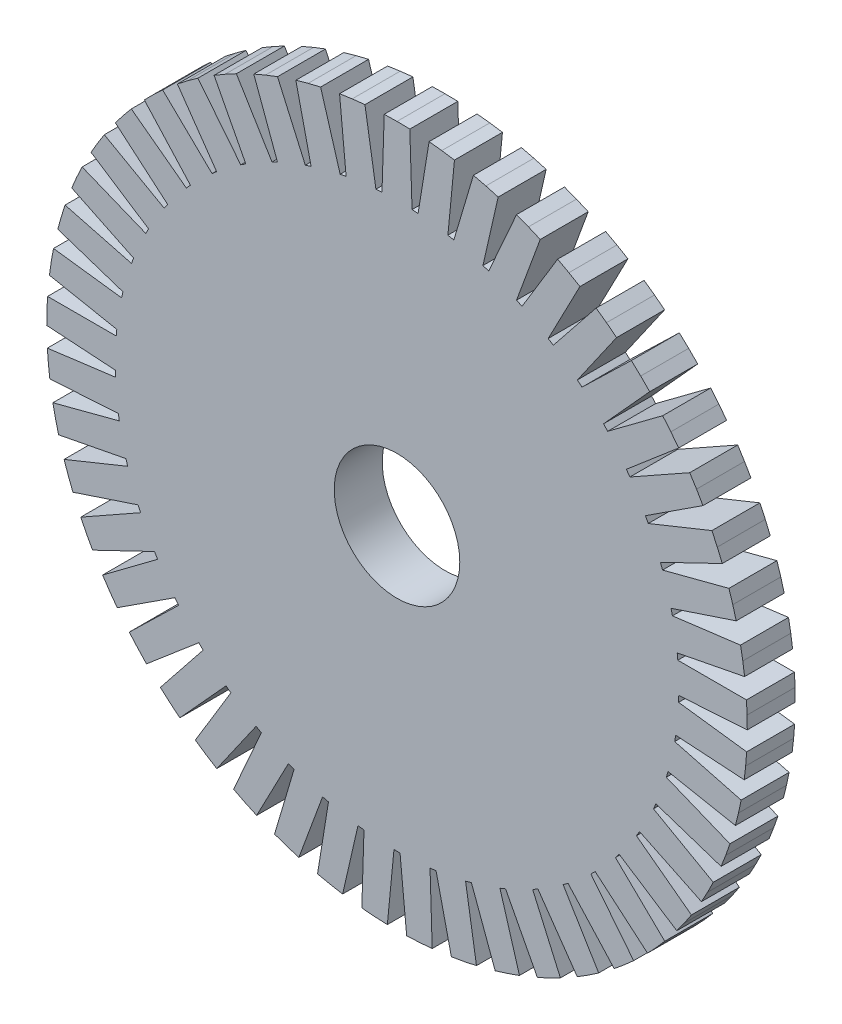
from build123d import *

# Parameters (mm, degrees)
SKETCH2_R           = 3.925
BOSS_EXTRUDE1_DEPTH = 3


with BuildPart() as part:
    # Sketch2 → Boss-Extrude1 (new body)
    with BuildSketch(Plane.XY):
        with BuildLine():
            Line((0, 21.9), (-0.799866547, 21.885388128))
            Line((-0.799866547, 21.885388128), (-0.939665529, 17.59492622))
            ThreePointArc((-0.939665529, 17.59492622), (-1.128917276, 17.58379782), (-1.318038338, 17.57063388))
            Line((-1.318038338, 17.57063388), (-2.005341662, 21.807994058))
            Line((-2.005341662, 21.807994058), (-2.800509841, 21.720201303))
            Line((-2.800509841, 21.720201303), (-3.59194097, 21.60342473))
            Line((-3.59194097, 21.60342473), (-3.181940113, 17.330310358))
            ThreePointArc((-3.181940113, 17.330310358), (-3.368215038, 17.295072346), (-3.554100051, 17.257832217))
            Line((-3.554100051, 17.257832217), (-4.777622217, 21.372513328))
            Line((-4.777622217, 21.372513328), (-5.555035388, 21.183757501))
            Line((-5.555035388, 21.183757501), (-6.325035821, 20.966733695))
            Line((-6.325035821, 20.966733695), (-5.371967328, 16.78113128))
            ThreePointArc((-5.371967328, 16.78113128), (-5.552206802, 16.722362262), (-5.731803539, 16.661657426))
            Line((-5.731803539, 16.661657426), (-7.471454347, 20.58609652))
            Line((-7.471454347, 20.58609652), (-8.218347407, 20.299476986))
            Line((-8.218347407, 20.299476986), (-8.95427376, 19.985769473))
            Line((-8.95427376, 19.985769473), (-7.473786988, 15.956406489))
            ThreePointArc((-7.473786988, 15.956406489), (-7.645031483, 15.875071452), (-7.815390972, 15.791898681))
            Line((-7.815390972, 15.791898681), (-10.042605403, 19.461656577))
            Line((-10.042605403, 19.461656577), (-10.746714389, 19.08187962))
            Line((-10.746714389, 19.08187962), (-11.43648277, 18.676639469))
            Line((-11.43648277, 18.676639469), (-9.452887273, 14.869677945))
            ThreePointArc((-9.452887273, 14.869677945), (-9.612324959, 14.767112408), (-9.770649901, 14.662837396))
            Line((-9.770649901, 14.662837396), (-12.448857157, 18.01765677))
            Line((-12.448857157, 18.01765677), (-13.098620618, 17.550958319))
            Line((-13.098620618, 17.550958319), (-13.73090505, 17.060839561))
            Line((-13.73090505, 17.060839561), (-11.27677141, 13.538789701))
            ThreePointArc((-11.27677141, 13.538789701), (-11.421784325, 13.416677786), (-11.565475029, 13.293012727))
            Line((-11.565475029, 13.293012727), (-14.650699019, 16.277807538))
            Line((-14.650699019, 16.277807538), (-15.235447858, 15.731850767))
            Line((-15.235447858, 15.731850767), (-15.799866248, 15.164901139))
            Line((-15.799866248, 15.164901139), (-12.915491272, 11.985594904))
            ThreePointArc((-12.915491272, 11.985594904), (-13.043698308, 11.845941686), (-13.170395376, 11.704917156))
            Line((-13.170395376, 11.704917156), (-16.611976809, 14.270677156))
            Line((-16.611976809, 14.270677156), (-17.122109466, 13.654426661))
            Line((-17.122109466, 13.654426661), (-17.609394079, 13.019955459))
            Line((-17.609394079, 13.019955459), (-14.342139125, 10.23559697))
            ThreePointArc((-14.342139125, 10.23559697), (-14.451435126, 10.080695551), (-14.559058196, 9.924627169))
            Line((-14.559058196, 9.924627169), (-18.300486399, 12.029222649))
            Line((-18.300486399, 12.029222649), (-18.72762651, 11.352797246))
            Line((-18.72762651, 11.352797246), (-19.129776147, 10.661222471))
            Line((-19.129776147, 10.661222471), (-15.53328945, 8.317530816))
            ThreePointArc((-15.53328945, 8.317530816), (-15.621879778, 8.149924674), (-15.708661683, 7.981375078))
            Line((-15.708661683, 7.981375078), (-19.688502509, 9.590248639))
            Line((-19.688502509, 9.590248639), (-20.025636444, 8.864755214))
            Line((-20.025636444, 8.864755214), (-20.336047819, 8.127432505))
            Line((-20.336047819, 8.127432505), (-16.469383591, 6.262891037))
            ThreePointArc((-16.469383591, 6.262891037), (-16.535813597, 6.085332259), (-16.600329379, 5.907069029))
            Line((-16.600329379, 5.907069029), (-20.753233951, 6.993803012))
            Line((-20.753233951, 6.993803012), (-20.994825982, 6.231154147))
            Line((-20.994825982, 6.231154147), (-21.208402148, 5.460190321))
            Line((-21.208402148, 5.460190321), (-17.135050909, 4.10541476))
            ThreePointArc((-17.135050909, 4.10541476), (-17.178229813, 3.920818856), (-17.219420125, 3.73576907))
            Line((-17.219420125, 3.73576907), (-21.477197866, 4.282519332))
            Line((-21.477197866, 4.282519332), (-21.619281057, 3.495237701))
            Line((-21.619281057, 3.495237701), (-21.7325151, 2.703291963))
            Line((-21.7325151, 2.703291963), (-17.519361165, 1.880527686))
            ThreePointArc((-17.519361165, 1.880527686), (-17.53857997, 1.691925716), (-17.55576847, 1.503127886))
            Line((-17.55576847, 1.503127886), (-21.848506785, 1.500916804))
            Line((-21.848506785, 1.500916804), (-21.888748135, 0.701929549))
            Line((-21.888748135, 0.701929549), (-21.899780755, -0.097994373))
            Line((-21.899780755, -0.097994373), (-17.616003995, -0.375237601))
            ThreePointArc((-17.616003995, -0.375237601), (-17.610947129, -0.564748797), (-17.603851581, -0.754194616))
            Line((-17.603851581, -0.754194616), (-21.861063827, -1.305330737))
            Line((-21.861063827, -1.305330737), (-21.798802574, -2.102904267))
            Line((-21.798802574, -2.102904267), (-21.707452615, -2.897671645))
            Line((-21.707452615, -2.897671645), (-17.423392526, -2.624841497))
            ThreePointArc((-17.423392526, -2.624841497), (-17.394143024, -2.81215015), (-17.362879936, -2.999133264))
            Line((-17.362879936, -2.999133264), (-21.514662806, -4.090144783))
            Line((-21.514662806, -4.090144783), (-21.350921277, -4.873208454))
            Line((-21.350921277, -4.873208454), (-21.158688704, -5.649769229))
            Line((-21.158688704, -5.649769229), (-16.944689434, -4.831345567))
            ThreePointArc((-16.944689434, -4.831345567), (-16.891727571, -5.013376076), (-16.836810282, -5.194826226))
            Line((-16.836810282, -5.194826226), (-20.814991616, -6.807798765))
            Line((-20.814991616, -6.807798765), (-20.552458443, -7.563494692))
            Line((-20.552458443, -7.563494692), (-20.262499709, -8.309097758))
            Line((-20.262499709, -8.309097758), (-16.18775501, -6.958519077))
            ThreePointArc((-16.18775501, -6.958519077), (-16.111950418, -7.132282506), (-16.034280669, -7.305220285))
            Line((-16.034280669, -7.305220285), (-19.773538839, -9.41366888))
            Line((-19.773538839, -9.41366888), (-19.41652481, -10.129588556))
            Line((-19.41652481, -10.129588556), (-19.033601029, -10.831991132))
            Line((-19.033601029, -10.831991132), (-15.165018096, -8.971433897))
            ThreePointArc((-15.165018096, -8.971433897), (-15.067615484, -9.134077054), (-14.968468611, -9.295662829))
            Line((-14.968468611, -9.295662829), (-18.407405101, -11.864966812))
            Line((-18.407405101, -11.864966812), (-17.961772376, -12.529354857))
            Line((-17.961772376, -12.529354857), (-17.492171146, -13.177023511))
            Line((-17.492171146, -13.177023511), (-13.893272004, -10.837038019))
            ThreePointArc((-13.893272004, -10.837038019), (-13.775870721, -10.985890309), (-13.656874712, -11.133470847))
            Line((-13.656874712, -11.133470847), (-16.73902228, -14.121442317))
            Line((-16.73902228, -14.121442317), (-16.212088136, -14.723389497))
            Line((-16.212088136, -14.723389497), (-15.663520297, -15.305689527))
            Line((-15.663520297, -15.305689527), (-12.39339877, -12.524698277))
            ThreePointArc((-12.39339877, -12.524698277), (-12.257926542, -12.657315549), (-12.121035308, -12.78846758))
            Line((-12.121035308, -12.78846758), (-14.795785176, -16.146044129))
            Line((-14.795785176, -16.146044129), (-14.196201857, -16.675666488))
            Line((-14.196201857, -16.675666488), (-13.577674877, -17.183036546))
            Line((-13.577674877, -17.183036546), (-10.69002627, -14.006703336))
            ThreePointArc((-10.69002627, -14.006703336), (-10.538707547, -14.120908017), (-10.386168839, -14.23347803))
            Line((-10.386168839, -14.23347803), (-12.609601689, -17.905528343))
            Line((-12.609601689, -17.905528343), (-11.947214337, -18.354129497))
            Line((-11.947214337, -18.354129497), (-11.268884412, -18.778238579))
            Line((-11.268884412, -18.778238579), (-8.811123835, -15.258718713))
            ThreePointArc((-8.811123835, -15.258718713), (-8.646443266, -15.352635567), (-8.480761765, -15.444775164))
            Line((-8.480761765, -15.444775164), (-10.21636889, -19.371004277))
            Line((-10.21636889, -19.371004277), (-9.502053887, -19.731218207))
            Line((-9.502053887, -19.731218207), (-8.775059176, -20.065102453))
            Line((-8.775059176, -20.065102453), (-6.78754299, -16.26018635))
            ThreePointArc((-6.78754299, -16.26018635), (-6.612204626, -16.332273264), (-6.436100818, -16.402469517))
            Line((-6.436100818, -16.402469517), (-7.655383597, -20.518408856))
            Line((-7.655383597, -20.518408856), (-6.900869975, -20.78432086))
            Line((-6.900869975, -20.78432086), (-6.13714771, -21.022497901))
            Line((-6.13714771, -21.022497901), (-4.652510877, -16.994662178))
            ThreePointArc((-4.652510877, -16.994662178), (-4.469393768, -17.043735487), (-4.285759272, -17.090835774))
            Line((-4.285759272, -17.090835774), (-4.968697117, -21.328901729))
            Line((-4.968697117, -21.328901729), (-4.186373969, -21.496145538))
            Line((-4.186373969, -21.496145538), (-3.398464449, -21.634704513))
            Line((-3.398464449, -21.634704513), (-2.441084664, -17.450086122))
            ThreePointArc((-2.441084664, -17.450086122), (-2.253195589, -17.475340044), (-2.065045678, -17.49857098))
            Line((-2.065045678, -17.49857098), (-2.200424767, -21.789174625))
            Line((-2.200424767, -21.789174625), (-1.403137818, -21.855004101))
            Line((-1.403137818, -21.855004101), (-0.603978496, -21.891669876))
            Line((-0.603978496, -21.891669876), (-0.189575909, -17.618980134))
            ThreePointArc((-0.189575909, -17.618980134), (0, -17.62), (0.189575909, -17.618980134))
            Line((0.189575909, -17.618980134), (0.603978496, -21.891669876))
            Line((0.603978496, -21.891669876), (1.403137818, -21.855004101))
            Line((1.403137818, -21.855004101), (2.200424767, -21.789174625))
            Line((2.200424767, -21.789174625), (2.065045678, -17.49857098))
            ThreePointArc((2.065045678, -17.49857098), (2.253195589, -17.475340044), (2.441084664, -17.450086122))
            Line((2.441084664, -17.450086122), (3.398464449, -21.634704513))
            Line((3.398464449, -21.634704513), (4.186373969, -21.496145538))
            Line((4.186373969, -21.496145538), (4.968697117, -21.328901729))
            Line((4.968697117, -21.328901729), (4.285759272, -17.090835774))
            ThreePointArc((4.285759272, -17.090835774), (4.469393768, -17.043735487), (4.652510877, -16.994662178))
            Line((4.652510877, -16.994662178), (6.13714771, -21.022497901))
            Line((6.13714771, -21.022497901), (6.900869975, -20.78432086))
            Line((6.900869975, -20.78432086), (7.655383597, -20.518408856))
            Line((7.655383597, -20.518408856), (6.436100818, -16.402469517))
            ThreePointArc((6.436100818, -16.402469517), (6.612204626, -16.332273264), (6.78754299, -16.26018635))
            Line((6.78754299, -16.26018635), (8.775059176, -20.065102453))
            Line((8.775059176, -20.065102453), (9.502053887, -19.731218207))
            Line((9.502053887, -19.731218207), (10.21636889, -19.371004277))
            Line((10.21636889, -19.371004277), (8.480761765, -15.444775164))
            ThreePointArc((8.480761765, -15.444775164), (8.646443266, -15.352635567), (8.811123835, -15.258718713))
            Line((8.811123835, -15.258718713), (11.268884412, -18.778238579))
            Line((11.268884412, -18.778238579), (11.947214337, -18.354129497))
            Line((11.947214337, -18.354129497), (12.609601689, -17.905528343))
            Line((12.609601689, -17.905528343), (10.386168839, -14.23347803))
            ThreePointArc((10.386168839, -14.23347803), (10.538707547, -14.120908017), (10.69002627, -14.006703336))
            Line((10.69002627, -14.006703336), (13.577674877, -17.183036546))
            Line((13.577674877, -17.183036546), (14.196201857, -16.675666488))
            Line((14.196201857, -16.675666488), (14.795785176, -16.146044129))
            Line((14.795785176, -16.146044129), (12.121035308, -12.78846758))
            ThreePointArc((12.121035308, -12.78846758), (12.257926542, -12.657315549), (12.39339877, -12.524698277))
            Line((12.39339877, -12.524698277), (15.663520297, -15.305689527))
            Line((15.663520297, -15.305689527), (16.212088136, -14.723389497))
            Line((16.212088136, -14.723389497), (16.73902228, -14.121442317))
            Line((16.73902228, -14.121442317), (13.656874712, -11.133470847))
            ThreePointArc((13.656874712, -11.133470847), (13.775870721, -10.985890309), (13.893272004, -10.837038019))
            Line((13.893272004, -10.837038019), (17.492171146, -13.177023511))
            Line((17.492171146, -13.177023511), (17.961772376, -12.529354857))
            Line((17.961772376, -12.529354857), (18.407405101, -11.864966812))
            Line((18.407405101, -11.864966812), (14.968468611, -9.295662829))
            ThreePointArc((14.968468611, -9.295662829), (15.067615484, -9.134077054), (15.165018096, -8.971433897))
            Line((15.165018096, -8.971433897), (19.033601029, -10.831991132))
            Line((19.033601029, -10.831991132), (19.41652481, -10.129588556))
            Line((19.41652481, -10.129588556), (19.773538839, -9.41366888))
            Line((19.773538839, -9.41366888), (16.034280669, -7.305220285))
            ThreePointArc((16.034280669, -7.305220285), (16.111950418, -7.132282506), (16.18775501, -6.958519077))
            Line((16.18775501, -6.958519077), (20.262499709, -8.309097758))
            Line((20.262499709, -8.309097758), (20.552458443, -7.563494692))
            Line((20.552458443, -7.563494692), (20.814991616, -6.807798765))
            Line((20.814991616, -6.807798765), (16.836810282, -5.194826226))
            ThreePointArc((16.836810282, -5.194826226), (16.891727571, -5.013376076), (16.944689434, -4.831345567))
            Line((16.944689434, -4.831345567), (21.158688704, -5.649769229))
            Line((21.158688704, -5.649769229), (21.350921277, -4.873208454))
            Line((21.350921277, -4.873208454), (21.514662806, -4.090144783))
            Line((21.514662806, -4.090144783), (17.362879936, -2.999133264))
            ThreePointArc((17.362879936, -2.999133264), (17.394143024, -2.81215015), (17.423392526, -2.624841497))
            Line((17.423392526, -2.624841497), (21.707452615, -2.897671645))
            Line((21.707452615, -2.897671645), (21.798802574, -2.102904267))
            Line((21.798802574, -2.102904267), (21.861063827, -1.305330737))
            Line((21.861063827, -1.305330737), (17.603851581, -0.754194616))
            ThreePointArc((17.603851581, -0.754194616), (17.610947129, -0.564748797), (17.616003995, -0.375237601))
            Line((17.616003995, -0.375237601), (21.899780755, -0.097994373))
            Line((21.899780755, -0.097994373), (21.888748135, 0.701929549))
            Line((21.888748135, 0.701929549), (21.848506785, 1.500916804))
            Line((21.848506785, 1.500916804), (17.55576847, 1.503127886))
            ThreePointArc((17.55576847, 1.503127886), (17.53857997, 1.691925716), (17.519361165, 1.880527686))
            Line((17.519361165, 1.880527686), (21.7325151, 2.703291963))
            Line((21.7325151, 2.703291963), (21.619281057, 3.495237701))
            Line((21.619281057, 3.495237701), (21.477197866, 4.282519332))
            Line((21.477197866, 4.282519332), (17.219420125, 3.73576907))
            ThreePointArc((17.219420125, 3.73576907), (17.178229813, 3.920818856), (17.135050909, 4.10541476))
            Line((17.135050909, 4.10541476), (21.208402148, 5.460190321))
            Line((21.208402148, 5.460190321), (20.994825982, 6.231154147))
            Line((20.994825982, 6.231154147), (20.753233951, 6.993803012))
            Line((20.753233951, 6.993803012), (16.600329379, 5.907069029))
            ThreePointArc((16.600329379, 5.907069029), (16.535813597, 6.085332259), (16.469383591, 6.262891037))
            Line((16.469383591, 6.262891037), (20.336047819, 8.127432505))
            Line((20.336047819, 8.127432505), (20.025636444, 8.864755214))
            Line((20.025636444, 8.864755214), (19.688502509, 9.590248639))
            Line((19.688502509, 9.590248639), (15.708661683, 7.981375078))
            ThreePointArc((15.708661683, 7.981375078), (15.621879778, 8.149924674), (15.53328945, 8.317530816))
            Line((15.53328945, 8.317530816), (19.129776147, 10.661222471))
            Line((19.129776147, 10.661222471), (18.72762651, 11.352797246))
            Line((18.72762651, 11.352797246), (18.300486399, 12.029222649))
            Line((18.300486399, 12.029222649), (14.559058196, 9.924627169))
            ThreePointArc((14.559058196, 9.924627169), (14.451435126, 10.080695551), (14.342139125, 10.23559697))
            Line((14.342139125, 10.23559697), (17.609394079, 13.019955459))
            Line((17.609394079, 13.019955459), (17.122109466, 13.654426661))
            Line((17.122109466, 13.654426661), (16.611976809, 14.270677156))
            Line((16.611976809, 14.270677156), (13.170395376, 11.704917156))
            ThreePointArc((13.170395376, 11.704917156), (13.043698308, 11.845941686), (12.915491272, 11.985594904))
            Line((12.915491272, 11.985594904), (15.799866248, 15.164901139))
            Line((15.799866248, 15.164901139), (15.235447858, 15.731850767))
            Line((15.235447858, 15.731850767), (14.650699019, 16.277807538))
            Line((14.650699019, 16.277807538), (11.565475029, 13.293012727))
            ThreePointArc((11.565475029, 13.293012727), (11.421784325, 13.416677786), (11.27677141, 13.538789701))
            Line((11.27677141, 13.538789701), (13.73090505, 17.060839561))
            Line((13.73090505, 17.060839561), (13.098620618, 17.550958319))
            Line((13.098620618, 17.550958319), (12.448857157, 18.01765677))
            Line((12.448857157, 18.01765677), (9.770649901, 14.662837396))
            ThreePointArc((9.770649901, 14.662837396), (9.612324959, 14.767112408), (9.452887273, 14.869677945))
            Line((9.452887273, 14.869677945), (11.43648277, 18.676639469))
            Line((11.43648277, 18.676639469), (10.746714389, 19.08187962))
            Line((10.746714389, 19.08187962), (10.042605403, 19.461656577))
            Line((10.042605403, 19.461656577), (7.815390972, 15.791898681))
            ThreePointArc((7.815390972, 15.791898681), (7.645031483, 15.875071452), (7.473786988, 15.956406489))
            Line((7.473786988, 15.956406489), (8.95427376, 19.985769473))
            Line((8.95427376, 19.985769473), (8.218347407, 20.299476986))
            Line((8.218347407, 20.299476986), (7.471454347, 20.58609652))
            Line((7.471454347, 20.58609652), (5.731803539, 16.661657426))
            ThreePointArc((5.731803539, 16.661657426), (5.552206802, 16.722362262), (5.371967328, 16.78113128))
            Line((5.371967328, 16.78113128), (6.325035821, 20.966733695))
            Line((6.325035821, 20.966733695), (5.555035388, 21.183757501))
            Line((5.555035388, 21.183757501), (4.777622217, 21.372513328))
            Line((4.777622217, 21.372513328), (3.554100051, 17.257832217))
            ThreePointArc((3.554100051, 17.257832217), (3.368215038, 17.295072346), (3.181940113, 17.330310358))
            Line((3.181940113, 17.330310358), (3.59194097, 21.60342473))
            Line((3.59194097, 21.60342473), (2.800509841, 21.720201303))
            Line((2.800509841, 21.720201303), (2.005341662, 21.807994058))
            Line((2.005341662, 21.807994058), (1.318038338, 17.57063388))
            ThreePointArc((1.318038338, 17.57063388), (1.128917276, 17.58379782), (0.939665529, 17.59492622))
            Line((0.939665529, 17.59492622), (0.799866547, 21.885388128))
            Line((0.799866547, 21.885388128), (0, 21.9))
        make_face()
        Circle(SKETCH2_R, mode=Mode.SUBTRACT)
    extrude(amount=BOSS_EXTRUDE1_DEPTH)


solid = part.part
